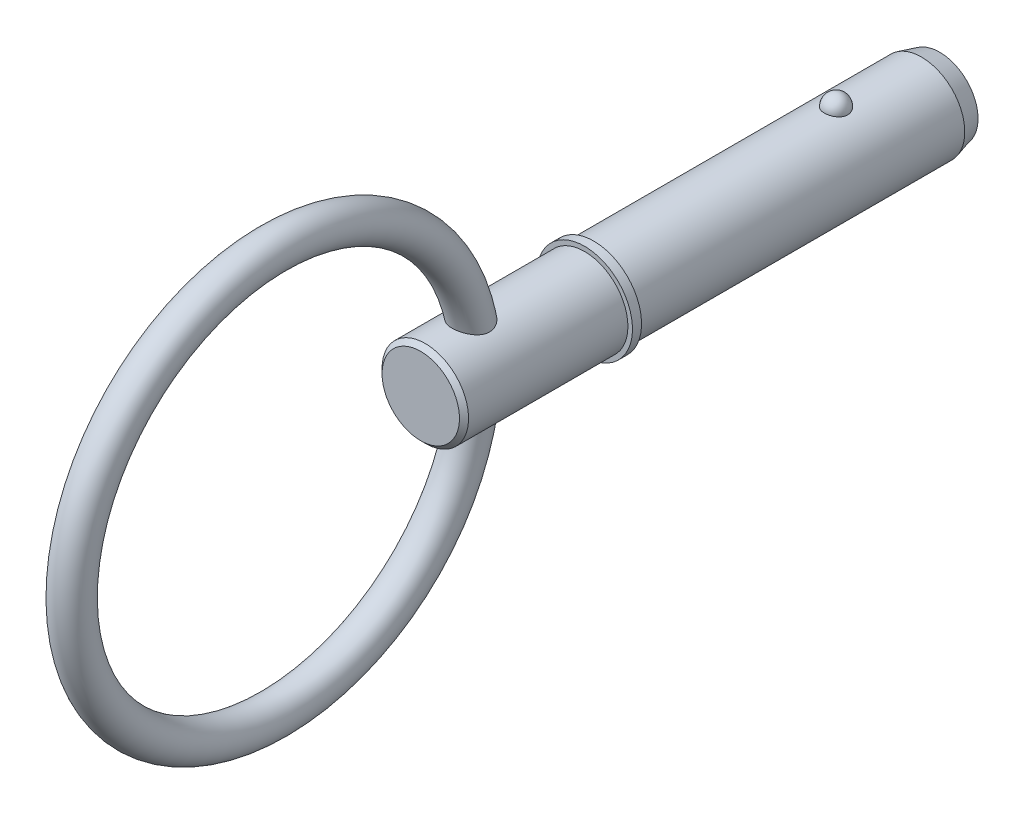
from build123d import *

# Parameters (mm, degrees)
SKETCH2_R           = 4.765
BOSS_EXTRUDE1_DEPTH = 25.4
BOSS_EXTRUDE2_START = 12.7
SKETCH3_R           = 4.765
BOSS_EXTRUDE2_DEPTH = 12.7
CHAMFER1_SIZE       = 2
CHAMFER1_SIZE2      = 0.535898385
SKETCH20_W          = 1
SKETCH20_H          = 5.265
SKETCH21_R          = 4.765
BOSS_EXTRUDE3_DEPTH = 19.05
CHAMFER2_SIZE       = 0.5
SKETCH24_R          = 2


with BuildPart() as part:
    # Sketch2 → Boss-Extrude1 (new body)
    with BuildSketch(Plane.XY):
        Circle(SKETCH2_R)
    extrude(amount=BOSS_EXTRUDE1_DEPTH)

    # Sketch3 → Boss-Extrude2 (add)
    with BuildSketch(Plane(origin=(0, 0, 0), x_dir=(-1, 0, 0), z_dir=(0, 0, -1)).offset(BOSS_EXTRUDE2_START)):
        Circle(SKETCH3_R)
    extrude(amount=-BOSS_EXTRUDE2_DEPTH)

    # Chamfer1
    chamfer1_edges = [part.edges().sort_by_distance(p)[0] for p in [
        (4.765, 0, -12.7),
    ]]
    chamfer1_side = [part.faces().sort_by_distance(p)[0] for p in [
        (4.765, 0, -6.35),
    ]]
    chamfer(chamfer1_edges, length=CHAMFER1_SIZE, length2=CHAMFER1_SIZE2, reference=chamfer1_side[0])

    # Sketch18 → Revolve1 (revolve)
    with BuildSketch(Plane(origin=(0, 0, 0), x_dir=(0, 0, -1), z_dir=(1, 0, 0))):
        with BuildLine():
            Line((1.29, 6.055), (1.29, 3.475))
            ThreePointArc((1.29, 3.475), (0, 4.765), (1.29, 6.055))
        make_face()
    revolve(axis=Axis((0, 6.055, -1.29), (0, -1, 0)))

    # Sketch20 → Revolve2 (revolve)
    with BuildSketch(Plane(origin=(0, 0, 0), x_dir=(0, 0, -1), z_dir=(1, 0, 0)), mode=Mode.PRIVATE) as revolve2_sk:
        with Locations((-25.9, 2.6325)):
            Rectangle(SKETCH20_W, SKETCH20_H)
    revolve(revolve2_sk.sketch.rotate(Axis((0, 0, 33.728787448), (0, 0, 1)), 90), axis=Axis((0, 0, 33.728787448), (0, 0, 1)))

    # Sketch21 → Boss-Extrude3 (add)
    with BuildSketch(Plane(origin=(0, 0, 25.4), x_dir=(-1, 0, 0), z_dir=(0, 0, -1))):
        Circle(SKETCH21_R)
    extrude(amount=-BOSS_EXTRUDE3_DEPTH)

    # Chamfer2
    chamfer2_edges = [part.edges().sort_by_distance(p)[0] for p in [
        (4.765, 0, 44.45),
    ]]
    chamfer(chamfer2_edges, length=CHAMFER2_SIZE)

    # Sweep1: sweep along a path in Sketch23
    with BuildLine(Plane(origin=(0, 0, 0), x_dir=(0, 0, -1), z_dir=(1, 0, 0))) as sweep1_path:
        CenterArc((-60.675, 0), 22.225, 0, 360)
    # Sketch24 → Sweep1 (sweep)
    with BuildSketch(Plane(origin=(0, 0, 0), x_dir=(1, 0, 0), z_dir=(0, 1, 0))):
        with Locations((0, -38.45)):
            Circle(SKETCH24_R)
    sweep(path=sweep1_path.line)


solid = part.part
